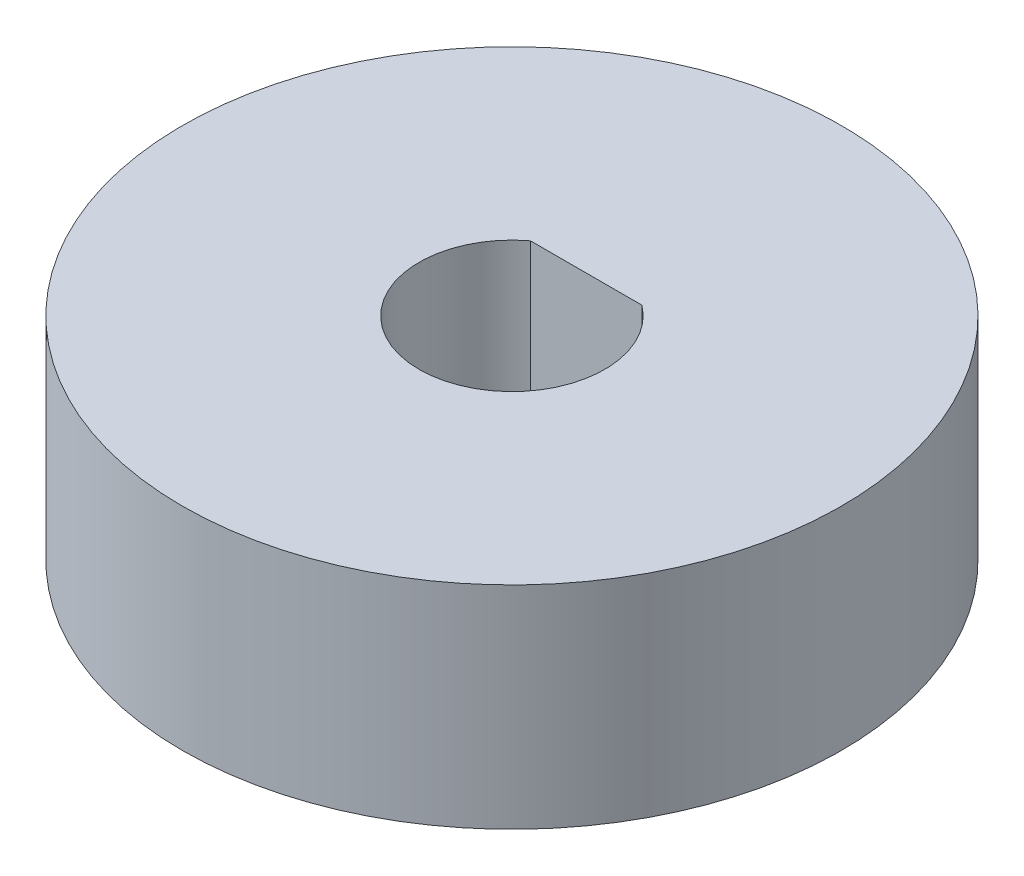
from build123d import *

# Parameters (mm, degrees)
SKETCH1_R      = 10.9
EXTRUDE1_DEPTH = 7


with BuildPart() as part:
    # Sketch1 → Extrude1 (new body)
    with BuildSketch(Plane(origin=(0, 0, 0), x_dir=(1, 0, 0), z_dir=(0, 1, 0))):
        with Locations(Location((0, 0, 0), (0, 0, 270))):
            Circle(SKETCH1_R)
        with BuildLine():
            Line((1.842533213, 2.4556), (-1.842533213, 2.4556))
            ThreePointArc((-1.842533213, 2.4556), (0, -3.07), (1.842533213, 2.4556))
        make_face(mode=Mode.SUBTRACT)
    extrude(amount=EXTRUDE1_DEPTH)


solid = part.part
